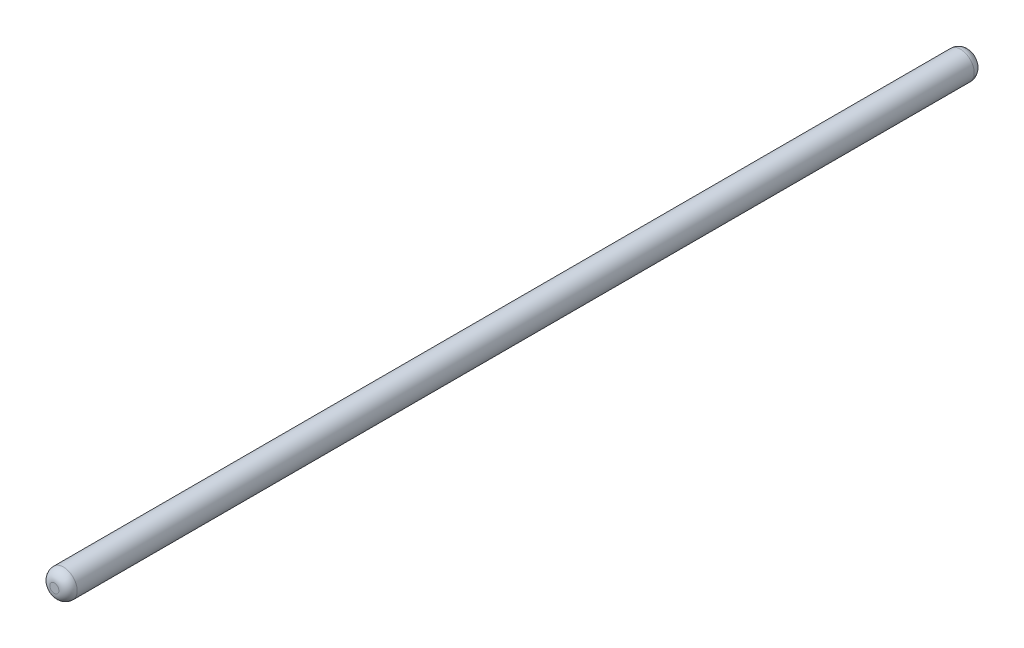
from build123d import *

# Parameters (mm, degrees)
CROQUIS1_R              = 1.5
SALIENTE_EXTRUIR1_DEPTH = 50
REDONDEO1_R             = 1


with BuildPart() as part:
    # Croquis1 → Saliente-Extruir1 (new, symmetric)
    with BuildSketch(Plane.XY):
        Circle(CROQUIS1_R)
    extrude(amount=SALIENTE_EXTRUIR1_DEPTH, both=True)

    # Redondeo1
    redondeo1_edges = [part.edges().sort_by_distance(p)[0] for p in [
        (-1.5, 0, -50),
        (-1.5, 0, 50),
    ]]
    fillet(redondeo1_edges, radius=REDONDEO1_R)


solid = part.part
